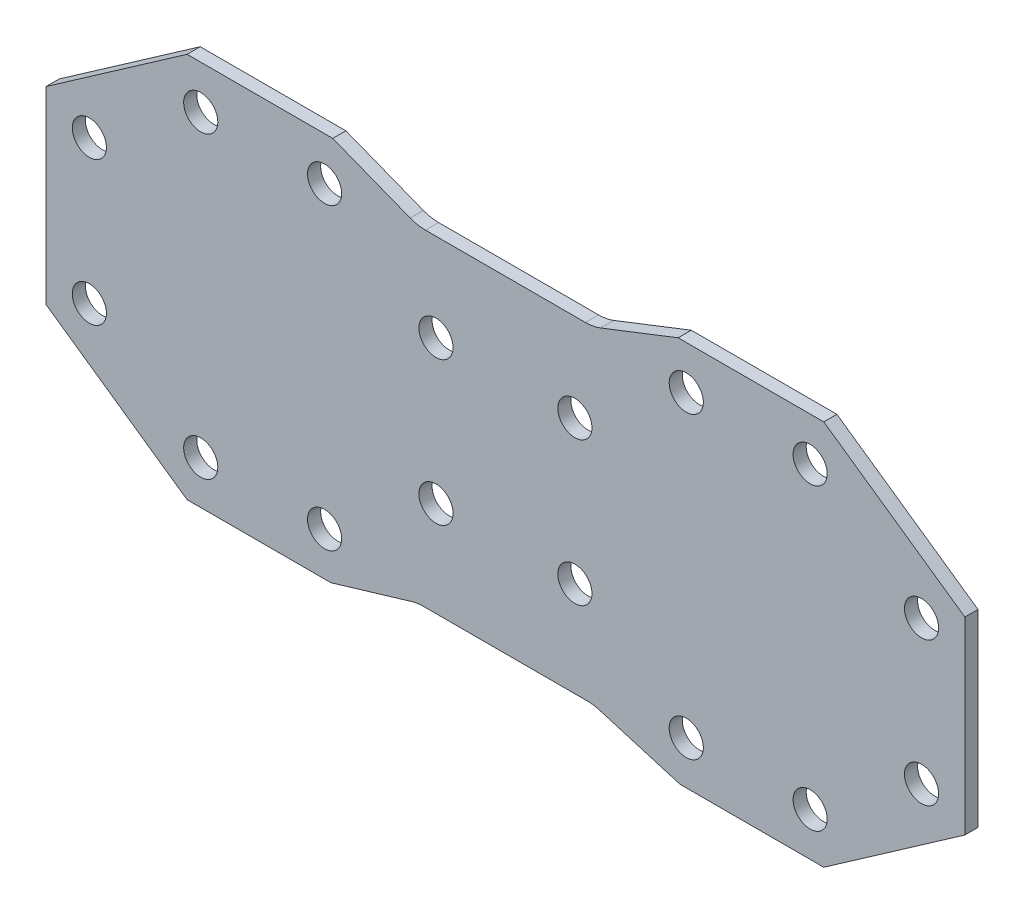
from build123d import *

# Parameters (mm, degrees)
MAIN_PLATE_DEPTH        = 31.75
CUT_EXTRUDE1_DEPTH      = 1762.00486901
CUT_EXTRUDE1_DEPTH_BACK = 1762.00486901
SKETCH5_R               = 41.275


with BuildPart() as part:
    # Sketch3 → Main Plate (new body)
    with BuildSketch(Plane(origin=(0, 0, 0), x_dir=(0, 1, 0), z_dir=(0, 0, 1))):
        with BuildLine():
            Line((466.324268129, 169.476784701), (466.324268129, -182.70492307))
            Line((466.324268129, -182.70492307), (228.234235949, -523.855268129))
            Line((228.234235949, -523.855268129), (-228.234235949, -523.855268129))
            Line((-228.234235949, -523.855268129), (-466.324268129, -182.70492307))
            Line((-466.324268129, -182.70492307), (-466.324268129, 165.037979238))
            Line((-466.324268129, 165.037979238), (-408.138164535, 360.294702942))
            ThreePointArc((-408.138164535, 360.294702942), (-404.970208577, 374.649076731), (-403.906803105, 389.310357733))
            Line((-403.906803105, 389.310357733), (-403.906803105, 784.677642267))
            ThreePointArc((-403.906803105, 784.677642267), (-404.970208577, 799.338923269), (-408.138164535, 813.693297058))
            Line((-408.138164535, 813.693297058), (-466.324268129, 1008.950020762))
            Line((-466.324268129, 1008.950020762), (-466.324268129, 1356.69292307))
            Line((-466.324268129, 1356.69292307), (-228.234235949, 1697.843268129))
            Line((-228.234235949, 1697.843268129), (228.234235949, 1697.843268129))
            Line((228.234235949, 1697.843268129), (466.324268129, 1356.69292307))
            Line((466.324268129, 1356.69292307), (466.324268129, 1004.511215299))
            Line((466.324268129, 1004.511215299), (393.274931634, 817.306570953))
            ThreePointArc((393.274931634, 817.306570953), (388.077053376, 799.164133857), (386.324268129, 780.37334606))
            Line((386.324268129, 780.37334606), (386.324268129, 393.61465394))
            ThreePointArc((386.324268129, 393.61465394), (388.077053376, 374.823866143), (393.274931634, 356.681429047))
            Line((393.274931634, 356.681429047), (466.324268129, 169.476784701))
        make_face()
    extrude(amount=MAIN_PLATE_DEPTH)

    # Sketch5 → Cut-Extrude1 (cut, two sides: drawn at the far end of the back side and taken through both)
    with BuildSketch(Plane(origin=(0, 0, 0), x_dir=(0, 1, 0), z_dir=(0, 0, 1)).offset(-CUT_EXTRUDE1_DEPTH_BACK)):
        with Locations(Location((-173.588730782, 419.080268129, 0), (0, 0, 270))):
            Circle(SKETCH5_R)
        with Locations(Location((173.588730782, 419.080268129, 0), (0, 0, 270))):
            Circle(SKETCH5_R)
        with Locations(Location((361.549268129, 149.758610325, 0), (0, 0, 270))):
            Circle(SKETCH5_R)
        with Locations(Location((361.549268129, -149.758610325, 0), (0, 0, 270))):
            Circle(SKETCH5_R)
        with Locations(Location((173.588730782, -419.080268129, 0), (0, 0, 270))):
            Circle(SKETCH5_R)
        with Locations(Location((-173.588730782, -419.080268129, 0), (0, 0, 270))):
            Circle(SKETCH5_R)
        with Locations(Location((-361.549268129, -149.758610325, 0), (0, 0, 270))):
            Circle(SKETCH5_R)
        with Locations(Location((-361.549268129, 149.758610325, 0), (0, 0, 270))):
            Circle(SKETCH5_R)
        with Locations(Location((-361.549268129, 1024.229389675, 0), (0, 0, 270))):
            Circle(SKETCH5_R)
        with Locations(Location((-173.588730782, 754.907731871, 0), (0, 0, 270))):
            Circle(SKETCH5_R)
        with Locations(Location((361.549268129, 1323.746610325, 0), (0, 0, 270))):
            Circle(SKETCH5_R)
        with Locations(Location((361.549268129, 1024.229389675, 0), (0, 0, 270))):
            Circle(SKETCH5_R)
        with Locations(Location((173.588730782, 754.907731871, 0), (0, 0, 270))):
            Circle(SKETCH5_R)
        with Locations(Location((-173.588730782, 1593.068268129, 0), (0, 0, 270))):
            Circle(SKETCH5_R)
        with Locations(Location((-361.549268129, 1323.746610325, 0), (0, 0, 270))):
            Circle(SKETCH5_R)
        with Locations(Location((173.588730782, 1593.068268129, 0), (0, 0, 270))):
            Circle(SKETCH5_R)
    extrude(amount=CUT_EXTRUDE1_DEPTH + CUT_EXTRUDE1_DEPTH_BACK, mode=Mode.SUBTRACT)


solid = part.part
